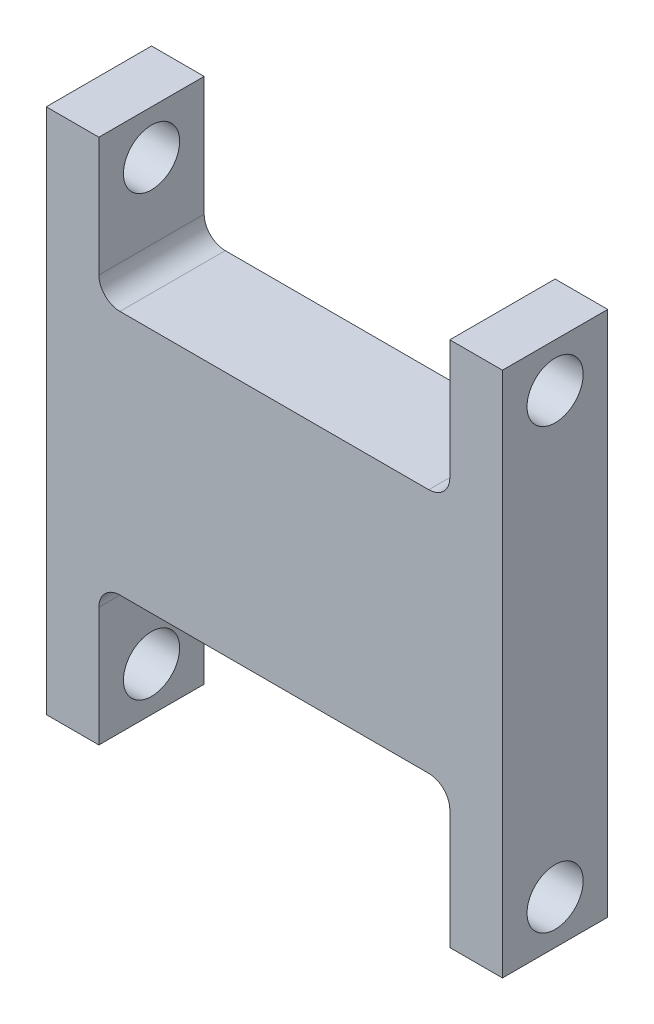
ISO-10303-21;
HEADER;
FILE_DESCRIPTION(('STEP AP214'),'2;1');
FILE_NAME('part.step','',(''),(''),'','','');
FILE_SCHEMA(('AUTOMOTIVE_DESIGN { 1 0 10303 214 1 1 1 1 }'));
ENDSEC;
DATA;
#1=APPLICATION_CONTEXT('core data for automotive mechanical design processes');
#2=APPLICATION_PROTOCOL_DEFINITION('international standard','automotive_design',2000,#1);
#3=PRODUCT_CONTEXT('',#1,'mechanical');
#4=PRODUCT('Part','Part','',(#3));
#5=PRODUCT_RELATED_PRODUCT_CATEGORY('part','',(#4));
#6=PRODUCT_DEFINITION_FORMATION('','',#4);
#7=PRODUCT_DEFINITION_CONTEXT('part definition',#1,'design');
#8=PRODUCT_DEFINITION('design','',#6,#7);
#9=PRODUCT_DEFINITION_SHAPE('','',#8);
#10=(LENGTH_UNIT() NAMED_UNIT(*) SI_UNIT(.MILLI.,.METRE.));
#11=(NAMED_UNIT(*) PLANE_ANGLE_UNIT() SI_UNIT($,.RADIAN.));
#12=(NAMED_UNIT(*) SI_UNIT($,.STERADIAN.) SOLID_ANGLE_UNIT());
#13=UNCERTAINTY_MEASURE_WITH_UNIT(LENGTH_MEASURE(1.E-05),#10,'distance_accuracy_value','');
#14=(GEOMETRIC_REPRESENTATION_CONTEXT(3) GLOBAL_UNCERTAINTY_ASSIGNED_CONTEXT((#13)) GLOBAL_UNIT_ASSIGNED_CONTEXT((#10,
#11,#12)) REPRESENTATION_CONTEXT('',''));
#15=CARTESIAN_POINT('',(0.,0.,0.));
#16=DIRECTION('',(0.,0.,1.));
#17=DIRECTION('',(1.,0.,0.));
#18=AXIS2_PLACEMENT_3D('',#15,#16,#17);
#19=CARTESIAN_POINT('',(50.,75.,15.));
#20=DIRECTION('',(0.,-1.,0.));
#21=DIRECTION('',(1.,0.,0.));
#22=AXIS2_PLACEMENT_3D('',#19,#20,#21);
#23=PLANE('',#22);
#24=DIRECTION('',(-1.,0.,0.));
#25=VECTOR('',#24,1.);
#26=CARTESIAN_POINT('',(50.,75.,-15.));
#27=LINE('',#26,#25);
#28=CARTESIAN_POINT('',(65.,75.,-15.));
#29=VERTEX_POINT('',#28);
#30=CARTESIAN_POINT('',(50.,75.,-15.));
#31=VERTEX_POINT('',#30);
#32=EDGE_CURVE('E149',#29,#31,#27,.T.);
#33=ORIENTED_EDGE('',*,*,#32,.T.);
#34=DIRECTION('',(0.,0.,-1.));
#35=VECTOR('',#34,1.);
#36=CARTESIAN_POINT('',(50.,75.,15.));
#37=LINE('',#36,#35);
#38=CARTESIAN_POINT('',(50.,75.,15.));
#39=VERTEX_POINT('',#38);
#40=EDGE_CURVE('E11',#39,#31,#37,.T.);
#41=ORIENTED_EDGE('',*,*,#40,.F.);
#42=DIRECTION('',(-1.,0.,0.));
#43=VECTOR('',#42,1.);
#44=CARTESIAN_POINT('',(50.,75.,15.));
#45=LINE('',#44,#43);
#46=CARTESIAN_POINT('',(65.,75.,15.));
#47=VERTEX_POINT('',#46);
#48=EDGE_CURVE('E197',#47,#39,#45,.T.);
#49=ORIENTED_EDGE('',*,*,#48,.F.);
#50=DIRECTION('',(0.,0.,-1.));
#51=VECTOR('',#50,1.);
#52=CARTESIAN_POINT('',(65.,75.,15.));
#53=LINE('',#52,#51);
#54=EDGE_CURVE('E162',#47,#29,#53,.T.);
#55=ORIENTED_EDGE('',*,*,#54,.T.);
#56=EDGE_LOOP('',(#33,#41,#49,#55));
#57=FACE_BOUND('',#56,.T.);
#58=ADVANCED_FACE('F33',(#57),#23,.F.);
#59=CARTESIAN_POINT('',(50.,41.,15.));
#60=DIRECTION('',(1.,0.,0.));
#61=DIRECTION('',(0.,0.,-1.));
#62=AXIS2_PLACEMENT_3D('',#59,#60,#61);
#63=PLANE('',#62);
#64=CARTESIAN_POINT('',(50.,62.5,0.));
#65=DIRECTION('',(1.,0.,0.));
#66=DIRECTION('',(0.,0.,-1.));
#67=AXIS2_PLACEMENT_3D('',#64,#65,#66);
#68=CIRCLE('',#67,8.);
#69=CARTESIAN_POINT('',(50.,62.5,-8.));
#70=VERTEX_POINT('',#69);
#71=EDGE_CURVE('E163',#70,#70,#68,.T.);
#72=ORIENTED_EDGE('',*,*,#71,.T.);
#73=EDGE_LOOP('',(#72));
#74=FACE_BOUND('',#73,.T.);
#75=DIRECTION('',(0.,-1.,0.));
#76=VECTOR('',#75,1.);
#77=CARTESIAN_POINT('',(50.,41.,-15.));
#78=LINE('',#77,#76);
#79=CARTESIAN_POINT('',(50.,41.,-15.));
#80=VERTEX_POINT('',#79);
#81=EDGE_CURVE('E145',#31,#80,#78,.T.);
#82=ORIENTED_EDGE('',*,*,#81,.T.);
#83=DIRECTION('',(0.,0.,-1.));
#84=VECTOR('',#83,1.);
#85=CARTESIAN_POINT('',(50.,41.,15.));
#86=LINE('',#85,#84);
#87=CARTESIAN_POINT('',(50.,41.,15.));
#88=VERTEX_POINT('',#87);
#89=EDGE_CURVE('E40',#88,#80,#86,.T.);
#90=ORIENTED_EDGE('',*,*,#89,.F.);
#91=DIRECTION('',(0.,-1.,0.));
#92=VECTOR('',#91,1.);
#93=CARTESIAN_POINT('',(50.,41.,15.));
#94=LINE('',#93,#92);
#95=EDGE_CURVE('E158',#39,#88,#94,.T.);
#96=ORIENTED_EDGE('',*,*,#95,.F.);
#97=ORIENTED_EDGE('',*,*,#40,.T.);
#98=EDGE_LOOP('',(#82,#90,#96,#97));
#99=FACE_BOUND('',#98,.T.);
#100=ADVANCED_FACE('F157',(#74,#99),#63,.F.);
#101=CARTESIAN_POINT('',(44.,41.,15.));
#102=DIRECTION('',(0.,0.,-1.));
#103=DIRECTION('',(-1.,0.,0.));
#104=AXIS2_PLACEMENT_3D('',#101,#102,#103);
#105=CYLINDRICAL_SURFACE('',#104,6.);
#106=CARTESIAN_POINT('',(44.,41.,-15.));
#107=DIRECTION('',(0.,0.,-1.));
#108=DIRECTION('',(1.,0.,0.));
#109=AXIS2_PLACEMENT_3D('',#106,#107,#108);
#110=CIRCLE('',#109,6.);
#111=CARTESIAN_POINT('',(44.,35.,-15.));
#112=VERTEX_POINT('',#111);
#113=EDGE_CURVE('E151',#80,#112,#110,.T.);
#114=ORIENTED_EDGE('',*,*,#113,.T.);
#115=DIRECTION('',(0.,0.,-1.));
#116=VECTOR('',#115,1.);
#117=CARTESIAN_POINT('',(44.,35.,15.));
#118=LINE('',#117,#116);
#119=CARTESIAN_POINT('',(44.,35.,15.));
#120=VERTEX_POINT('',#119);
#121=EDGE_CURVE('E265',#120,#112,#118,.T.);
#122=ORIENTED_EDGE('',*,*,#121,.F.);
#123=CARTESIAN_POINT('',(44.,41.,15.));
#124=DIRECTION('',(0.,0.,-1.));
#125=DIRECTION('',(1.,0.,0.));
#126=AXIS2_PLACEMENT_3D('',#123,#124,#125);
#127=CIRCLE('',#126,6.);
#128=EDGE_CURVE('E200',#88,#120,#127,.T.);
#129=ORIENTED_EDGE('',*,*,#128,.F.);
#130=ORIENTED_EDGE('',*,*,#89,.T.);
#131=EDGE_LOOP('',(#114,#122,#129,#130));
#132=FACE_BOUND('',#131,.T.);
#133=ADVANCED_FACE('F269',(#132),#105,.F.);
#134=CARTESIAN_POINT('',(-44.,35.,15.));
#135=DIRECTION('',(0.,-1.,0.));
#136=DIRECTION('',(1.,0.,0.));
#137=AXIS2_PLACEMENT_3D('',#134,#135,#136);
#138=PLANE('',#137);
#139=DIRECTION('',(-1.,0.,0.));
#140=VECTOR('',#139,1.);
#141=CARTESIAN_POINT('',(-44.,35.,-15.));
#142=LINE('',#141,#140);
#143=CARTESIAN_POINT('',(-44.,35.,-15.));
#144=VERTEX_POINT('',#143);
#145=EDGE_CURVE('E171',#112,#144,#142,.T.);
#146=ORIENTED_EDGE('',*,*,#145,.T.);
#147=DIRECTION('',(0.,0.,-1.));
#148=VECTOR('',#147,1.);
#149=CARTESIAN_POINT('',(-44.,35.,15.));
#150=LINE('',#149,#148);
#151=CARTESIAN_POINT('',(-44.,35.,15.));
#152=VERTEX_POINT('',#151);
#153=EDGE_CURVE('E262',#152,#144,#150,.T.);
#154=ORIENTED_EDGE('',*,*,#153,.F.);
#155=DIRECTION('',(-1.,0.,0.));
#156=VECTOR('',#155,1.);
#157=CARTESIAN_POINT('',(-44.,35.,15.));
#158=LINE('',#157,#156);
#159=EDGE_CURVE('E202',#120,#152,#158,.T.);
#160=ORIENTED_EDGE('',*,*,#159,.F.);
#161=ORIENTED_EDGE('',*,*,#121,.T.);
#162=EDGE_LOOP('',(#146,#154,#160,#161));
#163=FACE_BOUND('',#162,.T.);
#164=ADVANCED_FACE('F277',(#163),#138,.F.);
#165=CARTESIAN_POINT('',(-44.,41.,15.));
#166=DIRECTION('',(0.,0.,-1.));
#167=DIRECTION('',(-1.,0.,0.));
#168=AXIS2_PLACEMENT_3D('',#165,#166,#167);
#169=CYLINDRICAL_SURFACE('',#168,5.99999999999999);
#170=CARTESIAN_POINT('',(-44.,41.,-15.));
#171=DIRECTION('',(0.,0.,-1.));
#172=DIRECTION('',(-1.,0.,0.));
#173=AXIS2_PLACEMENT_3D('',#170,#171,#172);
#174=CIRCLE('',#173,5.99999999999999);
#175=CARTESIAN_POINT('',(-50.,41.,-15.));
#176=VERTEX_POINT('',#175);
#177=EDGE_CURVE('E173',#144,#176,#174,.T.);
#178=ORIENTED_EDGE('',*,*,#177,.T.);
#179=DIRECTION('',(0.,0.,-1.));
#180=VECTOR('',#179,1.);
#181=CARTESIAN_POINT('',(-50.,41.,15.));
#182=LINE('',#181,#180);
#183=CARTESIAN_POINT('',(-50.,41.,15.));
#184=VERTEX_POINT('',#183);
#185=EDGE_CURVE('E259',#184,#176,#182,.T.);
#186=ORIENTED_EDGE('',*,*,#185,.F.);
#187=CARTESIAN_POINT('',(-44.,41.,15.));
#188=DIRECTION('',(0.,0.,-1.));
#189=DIRECTION('',(-1.,0.,0.));
#190=AXIS2_PLACEMENT_3D('',#187,#188,#189);
#191=CIRCLE('',#190,5.99999999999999);
#192=EDGE_CURVE('E204',#152,#184,#191,.T.);
#193=ORIENTED_EDGE('',*,*,#192,.F.);
#194=ORIENTED_EDGE('',*,*,#153,.T.);
#195=EDGE_LOOP('',(#178,#186,#193,#194));
#196=FACE_BOUND('',#195,.T.);
#197=ADVANCED_FACE('F280',(#196),#169,.F.);
#198=CARTESIAN_POINT('',(-50.,41.,15.));
#199=DIRECTION('',(-1.,0.,0.));
#200=DIRECTION('',(0.,0.,1.));
#201=AXIS2_PLACEMENT_3D('',#198,#199,#200);
#202=PLANE('',#201);
#203=CARTESIAN_POINT('',(-50.,62.5,0.));
#204=DIRECTION('',(-1.,0.,0.));
#205=DIRECTION('',(0.,0.,1.));
#206=AXIS2_PLACEMENT_3D('',#203,#204,#205);
#207=CIRCLE('',#206,8.);
#208=CARTESIAN_POINT('',(-50.,62.5,8.));
#209=VERTEX_POINT('',#208);
#210=EDGE_CURVE('E166',#209,#209,#207,.T.);
#211=ORIENTED_EDGE('',*,*,#210,.T.);
#212=EDGE_LOOP('',(#211));
#213=FACE_BOUND('',#212,.T.);
#214=DIRECTION('',(0.,1.,0.));
#215=VECTOR('',#214,1.);
#216=CARTESIAN_POINT('',(-50.,41.,-15.));
#217=LINE('',#216,#215);
#218=CARTESIAN_POINT('',(-50.,75.,-15.));
#219=VERTEX_POINT('',#218);
#220=EDGE_CURVE('E175',#176,#219,#217,.T.);
#221=ORIENTED_EDGE('',*,*,#220,.T.);
#222=DIRECTION('',(0.,0.,-1.));
#223=VECTOR('',#222,1.);
#224=CARTESIAN_POINT('',(-50.,75.,15.));
#225=LINE('',#224,#223);
#226=CARTESIAN_POINT('',(-50.,75.,15.));
#227=VERTEX_POINT('',#226);
#228=EDGE_CURVE('E256',#227,#219,#225,.T.);
#229=ORIENTED_EDGE('',*,*,#228,.F.);
#230=DIRECTION('',(0.,1.,0.));
#231=VECTOR('',#230,1.);
#232=CARTESIAN_POINT('',(-50.,41.,15.));
#233=LINE('',#232,#231);
#234=EDGE_CURVE('E206',#184,#227,#233,.T.);
#235=ORIENTED_EDGE('',*,*,#234,.F.);
#236=ORIENTED_EDGE('',*,*,#185,.T.);
#237=EDGE_LOOP('',(#221,#229,#235,#236));
#238=FACE_BOUND('',#237,.T.);
#239=ADVANCED_FACE('F285',(#213,#238),#202,.F.);
#240=CARTESIAN_POINT('',(-50.,75.,15.));
#241=DIRECTION('',(0.,-1.,0.));
#242=DIRECTION('',(1.,0.,0.));
#243=AXIS2_PLACEMENT_3D('',#240,#241,#242);
#244=PLANE('',#243);
#245=DIRECTION('',(-1.,0.,0.));
#246=VECTOR('',#245,1.);
#247=CARTESIAN_POINT('',(-50.,75.,-15.));
#248=LINE('',#247,#246);
#249=CARTESIAN_POINT('',(-65.,75.,-15.));
#250=VERTEX_POINT('',#249);
#251=EDGE_CURVE('E177',#219,#250,#248,.T.);
#252=ORIENTED_EDGE('',*,*,#251,.T.);
#253=DIRECTION('',(0.,0.,-1.));
#254=VECTOR('',#253,1.);
#255=CARTESIAN_POINT('',(-65.,75.,15.));
#256=LINE('',#255,#254);
#257=CARTESIAN_POINT('',(-65.,75.,15.));
#258=VERTEX_POINT('',#257);
#259=EDGE_CURVE('E253',#258,#250,#256,.T.);
#260=ORIENTED_EDGE('',*,*,#259,.F.);
#261=DIRECTION('',(-1.,0.,0.));
#262=VECTOR('',#261,1.);
#263=CARTESIAN_POINT('',(-50.,75.,15.));
#264=LINE('',#263,#262);
#265=EDGE_CURVE('E208',#227,#258,#264,.T.);
#266=ORIENTED_EDGE('',*,*,#265,.F.);
#267=ORIENTED_EDGE('',*,*,#228,.T.);
#268=EDGE_LOOP('',(#252,#260,#266,#267));
#269=FACE_BOUND('',#268,.T.);
#270=ADVANCED_FACE('F291',(#269),#244,.F.);
#271=CARTESIAN_POINT('',(-65.,75.,15.));
#272=DIRECTION('',(1.,0.,0.));
#273=DIRECTION('',(0.,0.,-1.));
#274=AXIS2_PLACEMENT_3D('',#271,#272,#273);
#275=PLANE('',#274);
#276=CARTESIAN_POINT('',(-65.,-62.5,0.));
#277=DIRECTION('',(1.,0.,0.));
#278=DIRECTION('',(0.,0.,-1.));
#279=AXIS2_PLACEMENT_3D('',#276,#277,#278);
#280=CIRCLE('',#279,8.);
#281=CARTESIAN_POINT('',(-65.,-62.5,-8.));
#282=VERTEX_POINT('',#281);
#283=EDGE_CURVE('E384',#282,#282,#280,.T.);
#284=ORIENTED_EDGE('',*,*,#283,.T.);
#285=EDGE_LOOP('',(#284));
#286=FACE_BOUND('',#285,.T.);
#287=CARTESIAN_POINT('',(-65.,62.5,0.));
#288=DIRECTION('',(1.,0.,0.));
#289=DIRECTION('',(0.,0.,-1.));
#290=AXIS2_PLACEMENT_3D('',#287,#288,#289);
#291=CIRCLE('',#290,8.);
#292=CARTESIAN_POINT('',(-65.,62.5,-8.));
#293=VERTEX_POINT('',#292);
#294=EDGE_CURVE('E396',#293,#293,#291,.T.);
#295=ORIENTED_EDGE('',*,*,#294,.T.);
#296=EDGE_LOOP('',(#295));
#297=FACE_BOUND('',#296,.T.);
#298=DIRECTION('',(0.,-1.,0.));
#299=VECTOR('',#298,1.);
#300=CARTESIAN_POINT('',(-65.,75.,-15.));
#301=LINE('',#300,#299);
#302=CARTESIAN_POINT('',(-65.,-75.,-15.));
#303=VERTEX_POINT('',#302);
#304=EDGE_CURVE('E179',#250,#303,#301,.T.);
#305=ORIENTED_EDGE('',*,*,#304,.T.);
#306=DIRECTION('',(0.,0.,-1.));
#307=VECTOR('',#306,1.);
#308=CARTESIAN_POINT('',(-65.,-75.,15.));
#309=LINE('',#308,#307);
#310=CARTESIAN_POINT('',(-65.,-75.,15.));
#311=VERTEX_POINT('',#310);
#312=EDGE_CURVE('E250',#311,#303,#309,.T.);
#313=ORIENTED_EDGE('',*,*,#312,.F.);
#314=DIRECTION('',(0.,-1.,0.));
#315=VECTOR('',#314,1.);
#316=CARTESIAN_POINT('',(-65.,75.,15.));
#317=LINE('',#316,#315);
#318=EDGE_CURVE('E210',#258,#311,#317,.T.);
#319=ORIENTED_EDGE('',*,*,#318,.F.);
#320=ORIENTED_EDGE('',*,*,#259,.T.);
#321=EDGE_LOOP('',(#305,#313,#319,#320));
#322=FACE_BOUND('',#321,.T.);
#323=ADVANCED_FACE('F295',(#286,#297,#322),#275,.F.);
#324=CARTESIAN_POINT('',(-50.,-75.,15.));
#325=DIRECTION('',(0.,1.,0.));
#326=DIRECTION('',(-1.,0.,0.));
#327=AXIS2_PLACEMENT_3D('',#324,#325,#326);
#328=PLANE('',#327);
#329=DIRECTION('',(1.,0.,0.));
#330=VECTOR('',#329,1.);
#331=CARTESIAN_POINT('',(-50.,-75.,-15.));
#332=LINE('',#331,#330);
#333=CARTESIAN_POINT('',(-50.,-75.,-15.));
#334=VERTEX_POINT('',#333);
#335=EDGE_CURVE('E181',#303,#334,#332,.T.);
#336=ORIENTED_EDGE('',*,*,#335,.T.);
#337=DIRECTION('',(0.,0.,-1.));
#338=VECTOR('',#337,1.);
#339=CARTESIAN_POINT('',(-50.,-75.,15.));
#340=LINE('',#339,#338);
#341=CARTESIAN_POINT('',(-50.,-75.,15.));
#342=VERTEX_POINT('',#341);
#343=EDGE_CURVE('E246',#342,#334,#340,.T.);
#344=ORIENTED_EDGE('',*,*,#343,.F.);
#345=DIRECTION('',(1.,0.,0.));
#346=VECTOR('',#345,1.);
#347=CARTESIAN_POINT('',(-50.,-75.,15.));
#348=LINE('',#347,#346);
#349=EDGE_CURVE('E212',#311,#342,#348,.T.);
#350=ORIENTED_EDGE('',*,*,#349,.F.);
#351=ORIENTED_EDGE('',*,*,#312,.T.);
#352=EDGE_LOOP('',(#336,#344,#350,#351));
#353=FACE_BOUND('',#352,.T.);
#354=ADVANCED_FACE('F300',(#353),#328,.F.);
#355=CARTESIAN_POINT('',(-50.,-41.,15.));
#356=DIRECTION('',(-1.,0.,0.));
#357=DIRECTION('',(0.,0.,1.));
#358=AXIS2_PLACEMENT_3D('',#355,#356,#357);
#359=PLANE('',#358);
#360=CARTESIAN_POINT('',(-50.,-62.5,0.));
#361=DIRECTION('',(-1.,0.,0.));
#362=DIRECTION('',(0.,0.,1.));
#363=AXIS2_PLACEMENT_3D('',#360,#361,#362);
#364=CIRCLE('',#363,8.);
#365=CARTESIAN_POINT('',(-50.,-62.5,8.));
#366=VERTEX_POINT('',#365);
#367=EDGE_CURVE('E383',#366,#366,#364,.T.);
#368=ORIENTED_EDGE('',*,*,#367,.T.);
#369=EDGE_LOOP('',(#368));
#370=FACE_BOUND('',#369,.T.);
#371=DIRECTION('',(0.,1.,0.));
#372=VECTOR('',#371,1.);
#373=CARTESIAN_POINT('',(-50.,-41.,-15.));
#374=LINE('',#373,#372);
#375=CARTESIAN_POINT('',(-50.,-41.,-15.));
#376=VERTEX_POINT('',#375);
#377=EDGE_CURVE('E183',#334,#376,#374,.T.);
#378=ORIENTED_EDGE('',*,*,#377,.T.);
#379=DIRECTION('',(0.,0.,-1.));
#380=VECTOR('',#379,1.);
#381=CARTESIAN_POINT('',(-50.,-41.,15.));
#382=LINE('',#381,#380);
#383=CARTESIAN_POINT('',(-50.,-41.,15.));
#384=VERTEX_POINT('',#383);
#385=EDGE_CURVE('E243',#384,#376,#382,.T.);
#386=ORIENTED_EDGE('',*,*,#385,.F.);
#387=DIRECTION('',(0.,1.,0.));
#388=VECTOR('',#387,1.);
#389=CARTESIAN_POINT('',(-50.,-41.,15.));
#390=LINE('',#389,#388);
#391=EDGE_CURVE('E214',#342,#384,#390,.T.);
#392=ORIENTED_EDGE('',*,*,#391,.F.);
#393=ORIENTED_EDGE('',*,*,#343,.T.);
#394=EDGE_LOOP('',(#378,#386,#392,#393));
#395=FACE_BOUND('',#394,.T.);
#396=ADVANCED_FACE('F306',(#370,#395),#359,.F.);
#397=CARTESIAN_POINT('',(-44.,-41.,15.));
#398=DIRECTION('',(0.,0.,-1.));
#399=DIRECTION('',(-1.,0.,0.));
#400=AXIS2_PLACEMENT_3D('',#397,#398,#399);
#401=CYLINDRICAL_SURFACE('',#400,5.99999999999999);
#402=CARTESIAN_POINT('',(-44.,-41.,-15.));
#403=DIRECTION('',(0.,0.,-1.));
#404=DIRECTION('',(-1.,0.,0.));
#405=AXIS2_PLACEMENT_3D('',#402,#403,#404);
#406=CIRCLE('',#405,5.99999999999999);
#407=CARTESIAN_POINT('',(-44.,-35.,-15.));
#408=VERTEX_POINT('',#407);
#409=EDGE_CURVE('E185',#376,#408,#406,.T.);
#410=ORIENTED_EDGE('',*,*,#409,.T.);
#411=DIRECTION('',(0.,0.,-1.));
#412=VECTOR('',#411,1.);
#413=CARTESIAN_POINT('',(-44.,-35.,15.));
#414=LINE('',#413,#412);
#415=CARTESIAN_POINT('',(-44.,-35.,15.));
#416=VERTEX_POINT('',#415);
#417=EDGE_CURVE('E240',#416,#408,#414,.T.);
#418=ORIENTED_EDGE('',*,*,#417,.F.);
#419=CARTESIAN_POINT('',(-44.,-41.,15.));
#420=DIRECTION('',(0.,0.,-1.));
#421=DIRECTION('',(-1.,0.,0.));
#422=AXIS2_PLACEMENT_3D('',#419,#420,#421);
#423=CIRCLE('',#422,5.99999999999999);
#424=EDGE_CURVE('E216',#384,#416,#423,.T.);
#425=ORIENTED_EDGE('',*,*,#424,.F.);
#426=ORIENTED_EDGE('',*,*,#385,.T.);
#427=EDGE_LOOP('',(#410,#418,#425,#426));
#428=FACE_BOUND('',#427,.T.);
#429=ADVANCED_FACE('F310',(#428),#401,.F.);
#430=CARTESIAN_POINT('',(-44.,-35.,15.));
#431=DIRECTION('',(0.,1.,0.));
#432=DIRECTION('',(-1.,0.,0.));
#433=AXIS2_PLACEMENT_3D('',#430,#431,#432);
#434=PLANE('',#433);
#435=DIRECTION('',(1.,0.,0.));
#436=VECTOR('',#435,1.);
#437=CARTESIAN_POINT('',(-44.,-35.,-15.));
#438=LINE('',#437,#436);
#439=CARTESIAN_POINT('',(44.,-35.,-15.));
#440=VERTEX_POINT('',#439);
#441=EDGE_CURVE('E187',#408,#440,#438,.T.);
#442=ORIENTED_EDGE('',*,*,#441,.T.);
#443=DIRECTION('',(0.,0.,-1.));
#444=VECTOR('',#443,1.);
#445=CARTESIAN_POINT('',(44.,-35.,15.));
#446=LINE('',#445,#444);
#447=CARTESIAN_POINT('',(44.,-35.,15.));
#448=VERTEX_POINT('',#447);
#449=EDGE_CURVE('E237',#448,#440,#446,.T.);
#450=ORIENTED_EDGE('',*,*,#449,.F.);
#451=DIRECTION('',(1.,0.,0.));
#452=VECTOR('',#451,1.);
#453=CARTESIAN_POINT('',(-44.,-35.,15.));
#454=LINE('',#453,#452);
#455=EDGE_CURVE('E218',#416,#448,#454,.T.);
#456=ORIENTED_EDGE('',*,*,#455,.F.);
#457=ORIENTED_EDGE('',*,*,#417,.T.);
#458=EDGE_LOOP('',(#442,#450,#456,#457));
#459=FACE_BOUND('',#458,.T.);
#460=ADVANCED_FACE('F315',(#459),#434,.F.);
#461=CARTESIAN_POINT('',(44.,-41.,15.));
#462=DIRECTION('',(0.,0.,-1.));
#463=DIRECTION('',(-1.,0.,0.));
#464=AXIS2_PLACEMENT_3D('',#461,#462,#463);
#465=CYLINDRICAL_SURFACE('',#464,6.);
#466=CARTESIAN_POINT('',(44.,-41.,-15.));
#467=DIRECTION('',(0.,0.,-1.));
#468=DIRECTION('',(1.,0.,0.));
#469=AXIS2_PLACEMENT_3D('',#466,#467,#468);
#470=CIRCLE('',#469,6.);
#471=CARTESIAN_POINT('',(50.,-41.,-15.));
#472=VERTEX_POINT('',#471);
#473=EDGE_CURVE('E189',#440,#472,#470,.T.);
#474=ORIENTED_EDGE('',*,*,#473,.T.);
#475=DIRECTION('',(0.,0.,-1.));
#476=VECTOR('',#475,1.);
#477=CARTESIAN_POINT('',(50.,-41.,15.));
#478=LINE('',#477,#476);
#479=CARTESIAN_POINT('',(50.,-41.,15.));
#480=VERTEX_POINT('',#479);
#481=EDGE_CURVE('E234',#480,#472,#478,.T.);
#482=ORIENTED_EDGE('',*,*,#481,.F.);
#483=CARTESIAN_POINT('',(44.,-41.,15.));
#484=DIRECTION('',(0.,0.,-1.));
#485=DIRECTION('',(1.,0.,0.));
#486=AXIS2_PLACEMENT_3D('',#483,#484,#485);
#487=CIRCLE('',#486,6.);
#488=EDGE_CURVE('E220',#448,#480,#487,.T.);
#489=ORIENTED_EDGE('',*,*,#488,.F.);
#490=ORIENTED_EDGE('',*,*,#449,.T.);
#491=EDGE_LOOP('',(#474,#482,#489,#490));
#492=FACE_BOUND('',#491,.T.);
#493=ADVANCED_FACE('F321',(#492),#465,.F.);
#494=CARTESIAN_POINT('',(50.,-41.,15.));
#495=DIRECTION('',(1.,0.,0.));
#496=DIRECTION('',(0.,0.,-1.));
#497=AXIS2_PLACEMENT_3D('',#494,#495,#496);
#498=PLANE('',#497);
#499=CARTESIAN_POINT('',(50.,-62.5,0.));
#500=DIRECTION('',(1.,0.,0.));
#501=DIRECTION('',(0.,0.,-1.));
#502=AXIS2_PLACEMENT_3D('',#499,#500,#501);
#503=CIRCLE('',#502,8.);
#504=CARTESIAN_POINT('',(50.,-62.5,-8.));
#505=VERTEX_POINT('',#504);
#506=EDGE_CURVE('E381',#505,#505,#503,.T.);
#507=ORIENTED_EDGE('',*,*,#506,.T.);
#508=EDGE_LOOP('',(#507));
#509=FACE_BOUND('',#508,.T.);
#510=DIRECTION('',(0.,-1.,0.));
#511=VECTOR('',#510,1.);
#512=CARTESIAN_POINT('',(50.,-41.,-15.));
#513=LINE('',#512,#511);
#514=CARTESIAN_POINT('',(50.,-75.,-15.));
#515=VERTEX_POINT('',#514);
#516=EDGE_CURVE('E191',#472,#515,#513,.T.);
#517=ORIENTED_EDGE('',*,*,#516,.T.);
#518=DIRECTION('',(0.,0.,-1.));
#519=VECTOR('',#518,1.);
#520=CARTESIAN_POINT('',(50.,-75.,15.));
#521=LINE('',#520,#519);
#522=CARTESIAN_POINT('',(50.,-75.,15.));
#523=VERTEX_POINT('',#522);
#524=EDGE_CURVE('E231',#523,#515,#521,.T.);
#525=ORIENTED_EDGE('',*,*,#524,.F.);
#526=DIRECTION('',(0.,-1.,0.));
#527=VECTOR('',#526,1.);
#528=CARTESIAN_POINT('',(50.,-41.,15.));
#529=LINE('',#528,#527);
#530=EDGE_CURVE('E222',#480,#523,#529,.T.);
#531=ORIENTED_EDGE('',*,*,#530,.F.);
#532=ORIENTED_EDGE('',*,*,#481,.T.);
#533=EDGE_LOOP('',(#517,#525,#531,#532));
#534=FACE_BOUND('',#533,.T.);
#535=ADVANCED_FACE('F325',(#509,#534),#498,.F.);
#536=CARTESIAN_POINT('',(50.,-75.,15.));
#537=DIRECTION('',(0.,1.,0.));
#538=DIRECTION('',(-1.,0.,0.));
#539=AXIS2_PLACEMENT_3D('',#536,#537,#538);
#540=PLANE('',#539);
#541=DIRECTION('',(1.,0.,0.));
#542=VECTOR('',#541,1.);
#543=CARTESIAN_POINT('',(50.,-75.,-15.));
#544=LINE('',#543,#542);
#545=CARTESIAN_POINT('',(65.,-75.,-15.));
#546=VERTEX_POINT('',#545);
#547=EDGE_CURVE('E193',#515,#546,#544,.T.);
#548=ORIENTED_EDGE('',*,*,#547,.T.);
#549=DIRECTION('',(0.,0.,-1.));
#550=VECTOR('',#549,1.);
#551=CARTESIAN_POINT('',(65.,-75.,15.));
#552=LINE('',#551,#550);
#553=CARTESIAN_POINT('',(65.,-75.,15.));
#554=VERTEX_POINT('',#553);
#555=EDGE_CURVE('E228',#554,#546,#552,.T.);
#556=ORIENTED_EDGE('',*,*,#555,.F.);
#557=DIRECTION('',(1.,0.,0.));
#558=VECTOR('',#557,1.);
#559=CARTESIAN_POINT('',(50.,-75.,15.));
#560=LINE('',#559,#558);
#561=EDGE_CURVE('E52',#523,#554,#560,.T.);
#562=ORIENTED_EDGE('',*,*,#561,.F.);
#563=ORIENTED_EDGE('',*,*,#524,.T.);
#564=EDGE_LOOP('',(#548,#556,#562,#563));
#565=FACE_BOUND('',#564,.T.);
#566=ADVANCED_FACE('F328',(#565),#540,.F.);
#567=CARTESIAN_POINT('',(65.,75.,15.));
#568=DIRECTION('',(-1.,0.,0.));
#569=DIRECTION('',(0.,0.,1.));
#570=AXIS2_PLACEMENT_3D('',#567,#568,#569);
#571=PLANE('',#570);
#572=CARTESIAN_POINT('',(65.,-62.5,0.));
#573=DIRECTION('',(1.,0.,0.));
#574=DIRECTION('',(0.,0.,-1.));
#575=AXIS2_PLACEMENT_3D('',#572,#573,#574);
#576=CIRCLE('',#575,8.);
#577=CARTESIAN_POINT('',(65.,-62.5,-8.));
#578=VERTEX_POINT('',#577);
#579=EDGE_CURVE('E390',#578,#578,#576,.T.);
#580=ORIENTED_EDGE('',*,*,#579,.F.);
#581=EDGE_LOOP('',(#580));
#582=FACE_BOUND('',#581,.T.);
#583=CARTESIAN_POINT('',(65.,62.5,0.));
#584=DIRECTION('',(1.,0.,0.));
#585=DIRECTION('',(0.,0.,-1.));
#586=AXIS2_PLACEMENT_3D('',#583,#584,#585);
#587=CIRCLE('',#586,8.);
#588=CARTESIAN_POINT('',(65.,62.5,-8.));
#589=VERTEX_POINT('',#588);
#590=EDGE_CURVE('E387',#589,#589,#587,.T.);
#591=ORIENTED_EDGE('',*,*,#590,.F.);
#592=EDGE_LOOP('',(#591));
#593=FACE_BOUND('',#592,.T.);
#594=DIRECTION('',(0.,1.,0.));
#595=VECTOR('',#594,1.);
#596=CARTESIAN_POINT('',(65.,75.,-15.));
#597=LINE('',#596,#595);
#598=EDGE_CURVE('E195',#546,#29,#597,.T.);
#599=ORIENTED_EDGE('',*,*,#598,.T.);
#600=ORIENTED_EDGE('',*,*,#54,.F.);
#601=DIRECTION('',(0.,1.,0.));
#602=VECTOR('',#601,1.);
#603=CARTESIAN_POINT('',(65.,75.,15.));
#604=LINE('',#603,#602);
#605=EDGE_CURVE('E47',#554,#47,#604,.T.);
#606=ORIENTED_EDGE('',*,*,#605,.F.);
#607=ORIENTED_EDGE('',*,*,#555,.T.);
#608=EDGE_LOOP('',(#599,#600,#606,#607));
#609=FACE_BOUND('',#608,.T.);
#610=ADVANCED_FACE('F330',(#582,#593,#609),#571,.F.);
#611=CARTESIAN_POINT('',(44.,-41.,15.));
#612=DIRECTION('',(0.,0.,1.));
#613=DIRECTION('',(1.,0.,0.));
#614=AXIS2_PLACEMENT_3D('',#611,#612,#613);
#615=PLANE('',#614);
#616=ORIENTED_EDGE('',*,*,#48,.T.);
#617=ORIENTED_EDGE('',*,*,#95,.T.);
#618=ORIENTED_EDGE('',*,*,#128,.T.);
#619=ORIENTED_EDGE('',*,*,#159,.T.);
#620=ORIENTED_EDGE('',*,*,#192,.T.);
#621=ORIENTED_EDGE('',*,*,#234,.T.);
#622=ORIENTED_EDGE('',*,*,#265,.T.);
#623=ORIENTED_EDGE('',*,*,#318,.T.);
#624=ORIENTED_EDGE('',*,*,#349,.T.);
#625=ORIENTED_EDGE('',*,*,#391,.T.);
#626=ORIENTED_EDGE('',*,*,#424,.T.);
#627=ORIENTED_EDGE('',*,*,#455,.T.);
#628=ORIENTED_EDGE('',*,*,#488,.T.);
#629=ORIENTED_EDGE('',*,*,#530,.T.);
#630=ORIENTED_EDGE('',*,*,#561,.T.);
#631=ORIENTED_EDGE('',*,*,#605,.T.);
#632=EDGE_LOOP('',(#616,#617,#618,#619,#620,#621,#622,#623,#624,#625,#626,#627,#628,#629,#630,#631));
#633=FACE_BOUND('',#632,.T.);
#634=ADVANCED_FACE('F272',(#633),#615,.T.);
#635=CARTESIAN_POINT('',(44.,-41.,-15.));
#636=DIRECTION('',(0.,0.,1.));
#637=DIRECTION('',(1.,0.,0.));
#638=AXIS2_PLACEMENT_3D('',#635,#636,#637);
#639=PLANE('',#638);
#640=ORIENTED_EDGE('',*,*,#32,.F.);
#641=ORIENTED_EDGE('',*,*,#598,.F.);
#642=ORIENTED_EDGE('',*,*,#547,.F.);
#643=ORIENTED_EDGE('',*,*,#516,.F.);
#644=ORIENTED_EDGE('',*,*,#473,.F.);
#645=ORIENTED_EDGE('',*,*,#441,.F.);
#646=ORIENTED_EDGE('',*,*,#409,.F.);
#647=ORIENTED_EDGE('',*,*,#377,.F.);
#648=ORIENTED_EDGE('',*,*,#335,.F.);
#649=ORIENTED_EDGE('',*,*,#304,.F.);
#650=ORIENTED_EDGE('',*,*,#251,.F.);
#651=ORIENTED_EDGE('',*,*,#220,.F.);
#652=ORIENTED_EDGE('',*,*,#177,.F.);
#653=ORIENTED_EDGE('',*,*,#145,.F.);
#654=ORIENTED_EDGE('',*,*,#113,.F.);
#655=ORIENTED_EDGE('',*,*,#81,.F.);
#656=EDGE_LOOP('',(#640,#641,#642,#643,#644,#645,#646,#647,#648,#649,#650,#651,#652,#653,#654,#655));
#657=FACE_BOUND('',#656,.T.);
#658=ADVANCED_FACE('F146',(#657),#639,.F.);
#659=CARTESIAN_POINT('',(-65.,62.5,0.));
#660=DIRECTION('',(1.,0.,0.));
#661=DIRECTION('',(0.,0.,-1.));
#662=AXIS2_PLACEMENT_3D('',#659,#660,#661);
#663=CYLINDRICAL_SURFACE('',#662,8.);
#664=ORIENTED_EDGE('',*,*,#590,.T.);
#665=EDGE_LOOP('',(#664));
#666=FACE_BOUND('',#665,.T.);
#667=ORIENTED_EDGE('',*,*,#71,.F.);
#668=EDGE_LOOP('',(#667));
#669=FACE_BOUND('',#668,.T.);
#670=ADVANCED_FACE('F404',(#666,#669),#663,.F.);
#671=ORIENTED_EDGE('',*,*,#294,.F.);
#672=EDGE_LOOP('',(#671));
#673=FACE_BOUND('',#672,.T.);
#674=ORIENTED_EDGE('',*,*,#210,.F.);
#675=EDGE_LOOP('',(#674));
#676=FACE_BOUND('',#675,.T.);
#677=ADVANCED_FACE('F401',(#673,#676),#663,.F.);
#678=CARTESIAN_POINT('',(-65.,-62.5,0.));
#679=DIRECTION('',(1.,0.,0.));
#680=DIRECTION('',(0.,0.,-1.));
#681=AXIS2_PLACEMENT_3D('',#678,#679,#680);
#682=CYLINDRICAL_SURFACE('',#681,8.);
#683=ORIENTED_EDGE('',*,*,#579,.T.);
#684=EDGE_LOOP('',(#683));
#685=FACE_BOUND('',#684,.T.);
#686=ORIENTED_EDGE('',*,*,#506,.F.);
#687=EDGE_LOOP('',(#686));
#688=FACE_BOUND('',#687,.T.);
#689=ADVANCED_FACE('F403',(#685,#688),#682,.F.);
#690=ORIENTED_EDGE('',*,*,#283,.F.);
#691=EDGE_LOOP('',(#690));
#692=FACE_BOUND('',#691,.T.);
#693=ORIENTED_EDGE('',*,*,#367,.F.);
#694=EDGE_LOOP('',(#693));
#695=FACE_BOUND('',#694,.T.);
#696=ADVANCED_FACE('F411',(#692,#695),#682,.F.);
#697=CLOSED_SHELL('',(#58,#100,#133,#164,#197,#239,#270,#323,#354,#396,#429,#460,#493,#535,#566,
#610,#634,#658,#670,#677,#689,#696));
#698=MANIFOLD_SOLID_BREP('B2',#697);
#699=ADVANCED_BREP_SHAPE_REPRESENTATION('',(#18,#698),#14);
#700=SHAPE_DEFINITION_REPRESENTATION(#9,#699);
ENDSEC;
END-ISO-10303-21;
